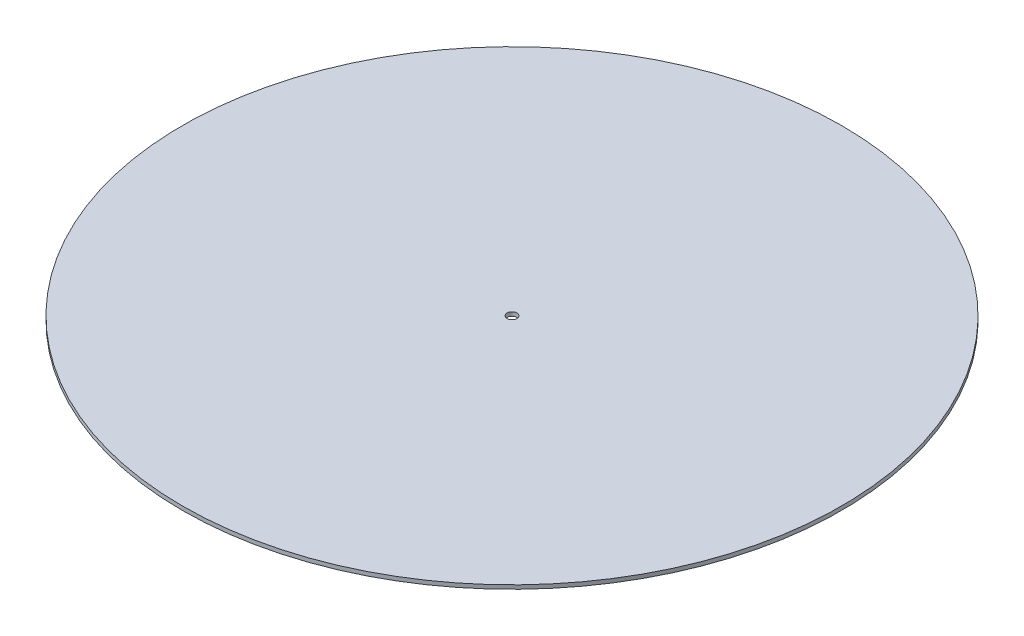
from build123d import *

# Parameters (mm, degrees)
SKETCH1_R           = 134.62
SKETCH1_R_2         = 2
BOSS_EXTRUDE1_DEPTH = 1.5875


with BuildPart() as part:
    # Sketch1 → Boss-Extrude1 (new body)
    with BuildSketch(Plane(origin=(0, 0, 0), x_dir=(1, 0, 0), z_dir=(0, 1, 0))):
        with Locations(Location((0, 0, 0), (0, 0, 270))):
            Circle(SKETCH1_R)
        with Locations(Location((0, 0, 0), (0, 0, 270))):
            Circle(SKETCH1_R_2, mode=Mode.SUBTRACT)
    extrude(amount=BOSS_EXTRUDE1_DEPTH)


solid = part.part
